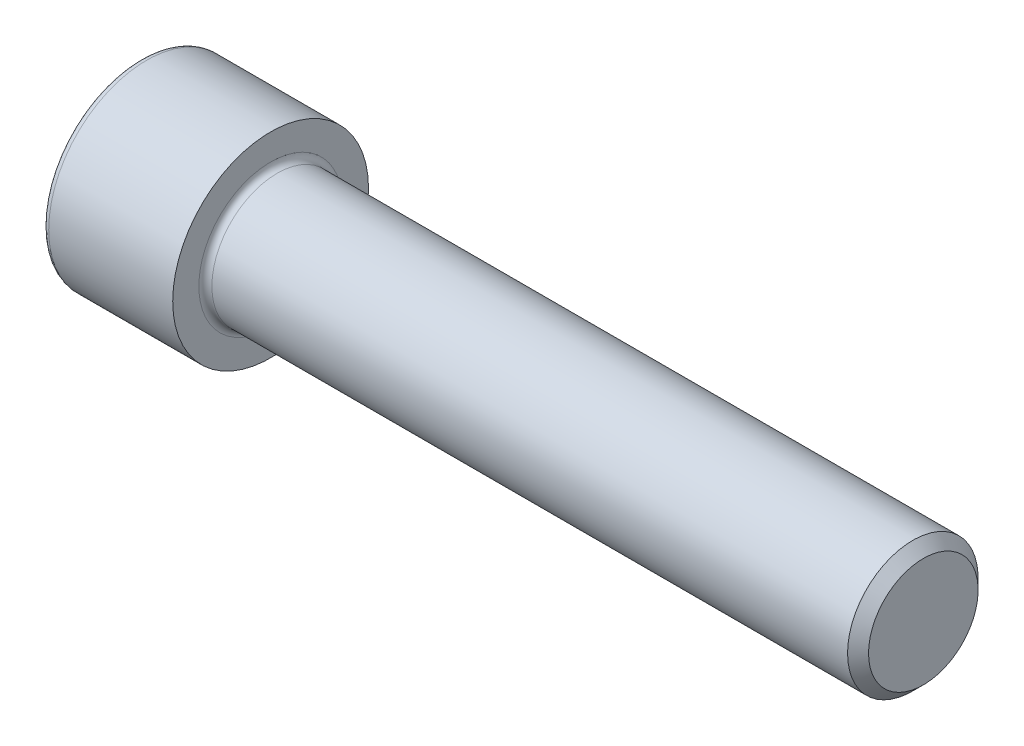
ISO-10303-21;
HEADER;
FILE_DESCRIPTION(('STEP AP214'),'2;1');
FILE_NAME('part.step','',(''),(''),'','','');
FILE_SCHEMA(('AUTOMOTIVE_DESIGN { 1 0 10303 214 1 1 1 1 }'));
ENDSEC;
DATA;
#1=APPLICATION_CONTEXT('core data for automotive mechanical design processes');
#2=APPLICATION_PROTOCOL_DEFINITION('international standard','automotive_design',2000,#1);
#3=PRODUCT_CONTEXT('',#1,'mechanical');
#4=PRODUCT('Part','Part','',(#3));
#5=PRODUCT_RELATED_PRODUCT_CATEGORY('part','',(#4));
#6=PRODUCT_DEFINITION_FORMATION('','',#4);
#7=PRODUCT_DEFINITION_CONTEXT('part definition',#1,'design');
#8=PRODUCT_DEFINITION('design','',#6,#7);
#9=PRODUCT_DEFINITION_SHAPE('','',#8);
#10=(LENGTH_UNIT() NAMED_UNIT(*) SI_UNIT(.MILLI.,.METRE.));
#11=(NAMED_UNIT(*) PLANE_ANGLE_UNIT() SI_UNIT($,.RADIAN.));
#12=(NAMED_UNIT(*) SI_UNIT($,.STERADIAN.) SOLID_ANGLE_UNIT());
#13=UNCERTAINTY_MEASURE_WITH_UNIT(LENGTH_MEASURE(1.E-05),#10,'distance_accuracy_value','');
#14=(GEOMETRIC_REPRESENTATION_CONTEXT(3) GLOBAL_UNCERTAINTY_ASSIGNED_CONTEXT((#13)) GLOBAL_UNIT_ASSIGNED_CONTEXT((#10,
#11,#12)) REPRESENTATION_CONTEXT('',''));
#15=CARTESIAN_POINT('',(0.,0.,0.));
#16=DIRECTION('',(0.,0.,1.));
#17=DIRECTION('',(1.,0.,0.));
#18=AXIS2_PLACEMENT_3D('',#15,#16,#17);
#19=CARTESIAN_POINT('',(0.,0.,0.));
#20=DIRECTION('',(-1.,0.,0.));
#21=DIRECTION('',(0.,0.,1.));
#22=AXIS2_PLACEMENT_3D('',#19,#20,#21);
#23=PLANE('',#22);
#24=DIRECTION('',(0.,-0.499999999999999,0.866025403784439));
#25=VECTOR('',#24,1.);
#26=CARTESIAN_POINT('',(0.,5.83989797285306,0.));
#27=LINE('',#26,#25);
#28=CARTESIAN_POINT('',(0.,5.83989797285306,0.));
#29=VERTEX_POINT('',#28);
#30=CARTESIAN_POINT('',(0.,2.91994898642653,5.0575));
#31=VERTEX_POINT('',#30);
#32=EDGE_CURVE('E266',#29,#31,#27,.T.);
#33=ORIENTED_EDGE('',*,*,#32,.T.);
#34=DIRECTION('',(0.,1.,0.));
#35=VECTOR('',#34,1.);
#36=CARTESIAN_POINT('',(0.,-2.91994898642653,5.0575));
#37=LINE('',#36,#35);
#38=CARTESIAN_POINT('',(0.,-2.91994898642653,5.0575));
#39=VERTEX_POINT('',#38);
#40=EDGE_CURVE('E138',#39,#31,#37,.T.);
#41=ORIENTED_EDGE('',*,*,#40,.F.);
#42=DIRECTION('',(0.,-0.500000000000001,-0.866025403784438));
#43=VECTOR('',#42,1.);
#44=CARTESIAN_POINT('',(0.,-2.91994898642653,5.0575));
#45=LINE('',#44,#43);
#46=CARTESIAN_POINT('',(0.,-5.83989797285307,0.));
#47=VERTEX_POINT('',#46);
#48=EDGE_CURVE('E269',#39,#47,#45,.T.);
#49=ORIENTED_EDGE('',*,*,#48,.T.);
#50=DIRECTION('',(0.,0.499999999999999,-0.866025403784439));
#51=VECTOR('',#50,1.);
#52=CARTESIAN_POINT('',(0.,-5.83989797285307,0.));
#53=LINE('',#52,#51);
#54=CARTESIAN_POINT('',(0.,-2.91994898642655,-5.0575));
#55=VERTEX_POINT('',#54);
#56=EDGE_CURVE('E272',#47,#55,#53,.T.);
#57=ORIENTED_EDGE('',*,*,#56,.T.);
#58=DIRECTION('',(0.,-1.,0.));
#59=VECTOR('',#58,1.);
#60=CARTESIAN_POINT('',(0.,2.91994898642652,-5.05750000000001));
#61=LINE('',#60,#59);
#62=CARTESIAN_POINT('',(0.,2.91994898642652,-5.05750000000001));
#63=VERTEX_POINT('',#62);
#64=EDGE_CURVE('E275',#63,#55,#61,.T.);
#65=ORIENTED_EDGE('',*,*,#64,.F.);
#66=DIRECTION('',(0.,-0.500000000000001,-0.866025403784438));
#67=VECTOR('',#66,1.);
#68=CARTESIAN_POINT('',(0.,5.83989797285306,0.));
#69=LINE('',#68,#67);
#70=EDGE_CURVE('E133',#29,#63,#69,.T.);
#71=ORIENTED_EDGE('',*,*,#70,.F.);
#72=EDGE_LOOP('',(#33,#41,#49,#57,#65,#71));
#73=FACE_BOUND('',#72,.T.);
#74=CARTESIAN_POINT('',(0.,0.,0.));
#75=DIRECTION('',(-1.,0.,0.));
#76=DIRECTION('',(0.,0.,1.));
#77=AXIS2_PLACEMENT_3D('',#74,#75,#76);
#78=CIRCLE('',#77,8.4);
#79=CARTESIAN_POINT('',(0.,0.,8.4));
#80=VERTEX_POINT('',#79);
#81=EDGE_CURVE('E50',#80,#80,#78,.T.);
#82=ORIENTED_EDGE('',*,*,#81,.T.);
#83=EDGE_LOOP('',(#82));
#84=FACE_BOUND('',#83,.T.);
#85=ADVANCED_FACE('F42',(#73,#84),#23,.T.);
#86=CARTESIAN_POINT('',(-31.75,0.,0.));
#87=DIRECTION('',(-1.,0.,0.));
#88=DIRECTION('',(0.,0.,1.));
#89=AXIS2_PLACEMENT_3D('',#86,#87,#88);
#90=CYLINDRICAL_SURFACE('',#89,9.);
#91=CARTESIAN_POINT('',(0.600000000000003,0.,0.));
#92=DIRECTION('',(-1.,0.,0.));
#93=DIRECTION('',(0.,0.,1.));
#94=AXIS2_PLACEMENT_3D('',#91,#92,#93);
#95=CIRCLE('',#94,9.);
#96=CARTESIAN_POINT('',(0.600000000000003,0.,9.));
#97=VERTEX_POINT('',#96);
#98=EDGE_CURVE('E13',#97,#97,#95,.F.);
#99=ORIENTED_EDGE('',*,*,#98,.T.);
#100=EDGE_LOOP('',(#99));
#101=FACE_BOUND('',#100,.T.);
#102=CARTESIAN_POINT('',(12.,0.,0.));
#103=DIRECTION('',(-1.,0.,0.));
#104=DIRECTION('',(0.,0.,1.));
#105=AXIS2_PLACEMENT_3D('',#102,#103,#104);
#106=CIRCLE('',#105,9.);
#107=CARTESIAN_POINT('',(12.,0.,9.));
#108=VERTEX_POINT('',#107);
#109=EDGE_CURVE('E156',#108,#108,#106,.T.);
#110=ORIENTED_EDGE('',*,*,#109,.T.);
#111=EDGE_LOOP('',(#110));
#112=FACE_BOUND('',#111,.T.);
#113=ADVANCED_FACE('F180',(#101,#112),#90,.T.);
#114=CARTESIAN_POINT('',(12.,9.,0.));
#115=DIRECTION('',(1.,0.,0.));
#116=DIRECTION('',(0.,0.,-1.));
#117=AXIS2_PLACEMENT_3D('',#114,#115,#116);
#118=PLANE('',#117);
#119=CARTESIAN_POINT('',(12.,0.,0.));
#120=DIRECTION('',(1.,0.,0.));
#121=DIRECTION('',(0.,0.,-1.));
#122=AXIS2_PLACEMENT_3D('',#119,#120,#121);
#123=CIRCLE('',#122,6.59999999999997);
#124=CARTESIAN_POINT('',(12.,0.,-6.59999999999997));
#125=VERTEX_POINT('',#124);
#126=EDGE_CURVE('E159',#125,#125,#123,.F.);
#127=ORIENTED_EDGE('',*,*,#126,.T.);
#128=EDGE_LOOP('',(#127));
#129=FACE_BOUND('',#128,.T.);
#130=ORIENTED_EDGE('',*,*,#109,.F.);
#131=EDGE_LOOP('',(#130));
#132=FACE_BOUND('',#131,.T.);
#133=ADVANCED_FACE('F186',(#129,#132),#118,.T.);
#134=CARTESIAN_POINT('',(-31.75,0.,0.));
#135=DIRECTION('',(-1.,0.,0.));
#136=DIRECTION('',(0.,0.,1.));
#137=AXIS2_PLACEMENT_3D('',#134,#135,#136);
#138=CYLINDRICAL_SURFACE('',#137,5.99999999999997);
#139=CARTESIAN_POINT('',(12.6,0.,0.));
#140=DIRECTION('',(1.,0.,0.));
#141=DIRECTION('',(0.,0.,-1.));
#142=AXIS2_PLACEMENT_3D('',#139,#140,#141);
#143=CIRCLE('',#142,5.99999999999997);
#144=CARTESIAN_POINT('',(12.6,0.,-5.99999999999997));
#145=VERTEX_POINT('',#144);
#146=EDGE_CURVE('E162',#145,#145,#143,.T.);
#147=ORIENTED_EDGE('',*,*,#146,.T.);
#148=EDGE_LOOP('',(#147));
#149=FACE_BOUND('',#148,.T.);
#150=CARTESIAN_POINT('',(71.0359999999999,0.,0.));
#151=DIRECTION('',(-1.,0.,0.));
#152=DIRECTION('',(0.,0.,1.));
#153=AXIS2_PLACEMENT_3D('',#150,#151,#152);
#154=CIRCLE('',#153,5.99999999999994);
#155=CARTESIAN_POINT('',(71.0359999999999,0.,5.99999999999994));
#156=VERTEX_POINT('',#155);
#157=EDGE_CURVE('E153',#156,#156,#154,.T.);
#158=ORIENTED_EDGE('',*,*,#157,.T.);
#159=EDGE_LOOP('',(#158));
#160=FACE_BOUND('',#159,.T.);
#161=ADVANCED_FACE('F192',(#149,#160),#138,.T.);
#162=CARTESIAN_POINT('',(72.,0.,0.));
#163=DIRECTION('',(-1.,0.,0.));
#164=DIRECTION('',(0.,0.,1.));
#165=AXIS2_PLACEMENT_3D('',#162,#163,#164);
#166=CONICAL_SURFACE('',#165,5.036,0.785398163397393);
#167=ORIENTED_EDGE('',*,*,#157,.F.);
#168=EDGE_LOOP('',(#167));
#169=FACE_BOUND('',#168,.T.);
#170=CARTESIAN_POINT('',(72.,0.,0.));
#171=DIRECTION('',(-1.,0.,0.));
#172=DIRECTION('',(0.,0.,1.));
#173=AXIS2_PLACEMENT_3D('',#170,#171,#172);
#174=CIRCLE('',#173,5.036);
#175=CARTESIAN_POINT('',(72.,0.,5.036));
#176=VERTEX_POINT('',#175);
#177=EDGE_CURVE('E149',#176,#176,#174,.T.);
#178=ORIENTED_EDGE('',*,*,#177,.T.);
#179=EDGE_LOOP('',(#178));
#180=FACE_BOUND('',#179,.T.);
#181=ADVANCED_FACE('F196',(#169,#180),#166,.T.);
#182=CARTESIAN_POINT('',(72.,5.036,0.));
#183=DIRECTION('',(1.,0.,0.));
#184=DIRECTION('',(0.,0.,-1.));
#185=AXIS2_PLACEMENT_3D('',#182,#183,#184);
#186=PLANE('',#185);
#187=ORIENTED_EDGE('',*,*,#177,.F.);
#188=EDGE_LOOP('',(#187));
#189=FACE_BOUND('',#188,.T.);
#190=ADVANCED_FACE('F176',(#189),#186,.T.);
#191=CARTESIAN_POINT('',(12.6,0.,0.));
#192=DIRECTION('',(1.,0.,0.));
#193=DIRECTION('',(0.,0.,-1.));
#194=AXIS2_PLACEMENT_3D('',#191,#192,#193);
#195=TOROIDAL_SURFACE('',#194,6.59999999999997,0.6);
#196=ORIENTED_EDGE('',*,*,#146,.F.);
#197=EDGE_LOOP('',(#196));
#198=FACE_BOUND('',#197,.T.);
#199=ORIENTED_EDGE('',*,*,#126,.F.);
#200=EDGE_LOOP('',(#199));
#201=FACE_BOUND('',#200,.T.);
#202=ADVANCED_FACE('F169',(#198,#201),#195,.F.);
#203=CARTESIAN_POINT('',(0.600000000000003,0.,0.));
#204=DIRECTION('',(-1.,0.,0.));
#205=DIRECTION('',(0.,0.,1.));
#206=AXIS2_PLACEMENT_3D('',#203,#204,#205);
#207=TOROIDAL_SURFACE('',#206,8.4,0.6);
#208=ORIENTED_EDGE('',*,*,#98,.F.);
#209=EDGE_LOOP('',(#208));
#210=FACE_BOUND('',#209,.T.);
#211=ORIENTED_EDGE('',*,*,#81,.F.);
#212=EDGE_LOOP('',(#211));
#213=FACE_BOUND('',#212,.T.);
#214=ADVANCED_FACE('F44',(#210,#213),#207,.T.);
#215=CARTESIAN_POINT('',(6.,5.83989797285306,0.));
#216=DIRECTION('',(0.,-0.866025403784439,-0.499999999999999));
#217=DIRECTION('',(0.,0.499999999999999,-0.866025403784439));
#218=AXIS2_PLACEMENT_3D('',#215,#216,#217);
#219=PLANE('',#218);
#220=ORIENTED_EDGE('',*,*,#32,.F.);
#221=DIRECTION('',(-1.,0.,0.));
#222=VECTOR('',#221,1.);
#223=CARTESIAN_POINT('',(6.,5.83989797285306,0.));
#224=LINE('',#223,#222);
#225=CARTESIAN_POINT('',(6.,5.83989797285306,0.));
#226=VERTEX_POINT('',#225);
#227=EDGE_CURVE('E256',#226,#29,#224,.T.);
#228=ORIENTED_EDGE('',*,*,#227,.F.);
#229=DIRECTION('',(0.,-0.499999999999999,0.866025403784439));
#230=VECTOR('',#229,1.);
#231=CARTESIAN_POINT('',(6.,5.83989797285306,0.));
#232=LINE('',#231,#230);
#233=CARTESIAN_POINT('',(6.,4.3799234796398,2.52875));
#234=VERTEX_POINT('',#233);
#235=EDGE_CURVE('E125',#226,#234,#232,.T.);
#236=ORIENTED_EDGE('',*,*,#235,.T.);
#237=CARTESIAN_POINT('',(6.,2.91994898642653,5.0575));
#238=VERTEX_POINT('',#237);
#239=EDGE_CURVE('E116',#234,#238,#232,.T.);
#240=ORIENTED_EDGE('',*,*,#239,.T.);
#241=DIRECTION('',(-1.,0.,0.));
#242=VECTOR('',#241,1.);
#243=CARTESIAN_POINT('',(6.,2.91994898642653,5.0575));
#244=LINE('',#243,#242);
#245=EDGE_CURVE('E130',#238,#31,#244,.T.);
#246=ORIENTED_EDGE('',*,*,#245,.T.);
#247=EDGE_LOOP('',(#220,#228,#236,#240,#246));
#248=FACE_BOUND('',#247,.T.);
#249=ADVANCED_FACE('F129',(#248),#219,.T.);
#250=CARTESIAN_POINT('',(6.,-2.91994898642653,5.0575));
#251=DIRECTION('',(0.,0.,1.));
#252=DIRECTION('',(0.,-1.,0.));
#253=AXIS2_PLACEMENT_3D('',#250,#251,#252);
#254=PLANE('',#253);
#255=ORIENTED_EDGE('',*,*,#40,.T.);
#256=ORIENTED_EDGE('',*,*,#245,.F.);
#257=DIRECTION('',(0.,1.,0.));
#258=VECTOR('',#257,1.);
#259=CARTESIAN_POINT('',(6.,-2.91994898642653,5.0575));
#260=LINE('',#259,#258);
#261=CARTESIAN_POINT('',(6.,0.,5.0575));
#262=VERTEX_POINT('',#261);
#263=EDGE_CURVE('E113',#262,#238,#260,.T.);
#264=ORIENTED_EDGE('',*,*,#263,.F.);
#265=CARTESIAN_POINT('',(6.,-2.91994898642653,5.0575));
#266=VERTEX_POINT('',#265);
#267=EDGE_CURVE('E124',#266,#262,#260,.T.);
#268=ORIENTED_EDGE('',*,*,#267,.F.);
#269=DIRECTION('',(-1.,0.,0.));
#270=VECTOR('',#269,1.);
#271=CARTESIAN_POINT('',(6.,-2.91994898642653,5.0575));
#272=LINE('',#271,#270);
#273=EDGE_CURVE('E140',#266,#39,#272,.T.);
#274=ORIENTED_EDGE('',*,*,#273,.T.);
#275=EDGE_LOOP('',(#255,#256,#264,#268,#274));
#276=FACE_BOUND('',#275,.T.);
#277=ADVANCED_FACE('F135',(#276),#254,.F.);
#278=CARTESIAN_POINT('',(6.,-2.91994898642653,5.0575));
#279=DIRECTION('',(0.,0.866025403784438,-0.500000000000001));
#280=DIRECTION('',(0.,0.500000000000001,0.866025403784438));
#281=AXIS2_PLACEMENT_3D('',#278,#279,#280);
#282=PLANE('',#281);
#283=ORIENTED_EDGE('',*,*,#48,.F.);
#284=ORIENTED_EDGE('',*,*,#273,.F.);
#285=DIRECTION('',(0.,-0.500000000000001,-0.866025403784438));
#286=VECTOR('',#285,1.);
#287=CARTESIAN_POINT('',(6.,-2.91994898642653,5.0575));
#288=LINE('',#287,#286);
#289=CARTESIAN_POINT('',(6.,-4.3799234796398,2.52875000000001));
#290=VERTEX_POINT('',#289);
#291=EDGE_CURVE('E295',#266,#290,#288,.T.);
#292=ORIENTED_EDGE('',*,*,#291,.T.);
#293=CARTESIAN_POINT('',(6.,-5.83989797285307,0.));
#294=VERTEX_POINT('',#293);
#295=EDGE_CURVE('E284',#290,#294,#288,.T.);
#296=ORIENTED_EDGE('',*,*,#295,.T.);
#297=DIRECTION('',(-1.,0.,0.));
#298=VECTOR('',#297,1.);
#299=CARTESIAN_POINT('',(6.,-5.83989797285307,0.));
#300=LINE('',#299,#298);
#301=EDGE_CURVE('E145',#294,#47,#300,.T.);
#302=ORIENTED_EDGE('',*,*,#301,.T.);
#303=EDGE_LOOP('',(#283,#284,#292,#296,#302));
#304=FACE_BOUND('',#303,.T.);
#305=ADVANCED_FACE('F210',(#304),#282,.T.);
#306=CARTESIAN_POINT('',(6.,-5.83989797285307,0.));
#307=DIRECTION('',(0.,0.866025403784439,0.499999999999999));
#308=DIRECTION('',(0.,-0.499999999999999,0.866025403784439));
#309=AXIS2_PLACEMENT_3D('',#306,#307,#308);
#310=PLANE('',#309);
#311=ORIENTED_EDGE('',*,*,#56,.F.);
#312=ORIENTED_EDGE('',*,*,#301,.F.);
#313=DIRECTION('',(0.,0.499999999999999,-0.866025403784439));
#314=VECTOR('',#313,1.);
#315=CARTESIAN_POINT('',(6.,-5.83989797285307,0.));
#316=LINE('',#315,#314);
#317=CARTESIAN_POINT('',(6.,-4.37992347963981,-2.52875));
#318=VERTEX_POINT('',#317);
#319=EDGE_CURVE('E262',#294,#318,#316,.T.);
#320=ORIENTED_EDGE('',*,*,#319,.T.);
#321=CARTESIAN_POINT('',(6.,-2.91994898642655,-5.0575));
#322=VERTEX_POINT('',#321);
#323=EDGE_CURVE('E294',#318,#322,#316,.T.);
#324=ORIENTED_EDGE('',*,*,#323,.T.);
#325=DIRECTION('',(-1.,0.,0.));
#326=VECTOR('',#325,1.);
#327=CARTESIAN_POINT('',(6.,-2.91994898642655,-5.0575));
#328=LINE('',#327,#326);
#329=EDGE_CURVE('E255',#322,#55,#328,.T.);
#330=ORIENTED_EDGE('',*,*,#329,.T.);
#331=EDGE_LOOP('',(#311,#312,#320,#324,#330));
#332=FACE_BOUND('',#331,.T.);
#333=ADVANCED_FACE('F213',(#332),#310,.T.);
#334=CARTESIAN_POINT('',(6.,2.91994898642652,-5.05750000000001));
#335=DIRECTION('',(0.,0.,-1.));
#336=DIRECTION('',(0.,1.,0.));
#337=AXIS2_PLACEMENT_3D('',#334,#335,#336);
#338=PLANE('',#337);
#339=ORIENTED_EDGE('',*,*,#64,.T.);
#340=ORIENTED_EDGE('',*,*,#329,.F.);
#341=DIRECTION('',(0.,-1.,0.));
#342=VECTOR('',#341,1.);
#343=CARTESIAN_POINT('',(6.,2.91994898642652,-5.05750000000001));
#344=LINE('',#343,#342);
#345=CARTESIAN_POINT('',(6.,0.,-5.0575));
#346=VERTEX_POINT('',#345);
#347=EDGE_CURVE('E259',#346,#322,#344,.T.);
#348=ORIENTED_EDGE('',*,*,#347,.F.);
#349=CARTESIAN_POINT('',(6.,2.91994898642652,-5.05750000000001));
#350=VERTEX_POINT('',#349);
#351=EDGE_CURVE('E57',#350,#346,#344,.T.);
#352=ORIENTED_EDGE('',*,*,#351,.F.);
#353=DIRECTION('',(-1.,0.,0.));
#354=VECTOR('',#353,1.);
#355=CARTESIAN_POINT('',(6.,2.91994898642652,-5.05750000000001));
#356=LINE('',#355,#354);
#357=EDGE_CURVE('E252',#350,#63,#356,.T.);
#358=ORIENTED_EDGE('',*,*,#357,.T.);
#359=EDGE_LOOP('',(#339,#340,#348,#352,#358));
#360=FACE_BOUND('',#359,.T.);
#361=ADVANCED_FACE('F217',(#360),#338,.F.);
#362=CARTESIAN_POINT('',(6.,5.83989797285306,0.));
#363=DIRECTION('',(0.,0.866025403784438,-0.500000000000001));
#364=DIRECTION('',(0.,0.500000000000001,0.866025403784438));
#365=AXIS2_PLACEMENT_3D('',#362,#363,#364);
#366=PLANE('',#365);
#367=ORIENTED_EDGE('',*,*,#70,.T.);
#368=ORIENTED_EDGE('',*,*,#357,.F.);
#369=DIRECTION('',(0.,-0.500000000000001,-0.866025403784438));
#370=VECTOR('',#369,1.);
#371=CARTESIAN_POINT('',(6.,5.83989797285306,0.));
#372=LINE('',#371,#370);
#373=CARTESIAN_POINT('',(6.,4.37992347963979,-2.52875000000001));
#374=VERTEX_POINT('',#373);
#375=EDGE_CURVE('E242',#374,#350,#372,.T.);
#376=ORIENTED_EDGE('',*,*,#375,.F.);
#377=EDGE_CURVE('E248',#226,#374,#372,.T.);
#378=ORIENTED_EDGE('',*,*,#377,.F.);
#379=ORIENTED_EDGE('',*,*,#227,.T.);
#380=EDGE_LOOP('',(#367,#368,#376,#378,#379));
#381=FACE_BOUND('',#380,.T.);
#382=ADVANCED_FACE('F221',(#381),#366,.F.);
#383=CARTESIAN_POINT('',(6.,5.83989797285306,0.));
#384=DIRECTION('',(1.,0.,0.));
#385=DIRECTION('',(0.,0.,-1.));
#386=AXIS2_PLACEMENT_3D('',#383,#384,#385);
#387=PLANE('',#386);
#388=ORIENTED_EDGE('',*,*,#347,.T.);
#389=ORIENTED_EDGE('',*,*,#323,.F.);
#390=CARTESIAN_POINT('',(6.,0.,0.));
#391=DIRECTION('',(-1.,0.,0.));
#392=DIRECTION('',(0.,0.,1.));
#393=AXIS2_PLACEMENT_3D('',#390,#391,#392);
#394=CIRCLE('',#393,5.0575);
#395=EDGE_CURVE('E290',#346,#318,#394,.T.);
#396=ORIENTED_EDGE('',*,*,#395,.F.);
#397=EDGE_LOOP('',(#388,#389,#396));
#398=FACE_BOUND('',#397,.T.);
#399=ADVANCED_FACE('F225',(#398),#387,.F.);
#400=ORIENTED_EDGE('',*,*,#319,.F.);
#401=ORIENTED_EDGE('',*,*,#295,.F.);
#402=EDGE_CURVE('E143',#318,#290,#394,.T.);
#403=ORIENTED_EDGE('',*,*,#402,.F.);
#404=EDGE_LOOP('',(#400,#401,#403));
#405=FACE_BOUND('',#404,.T.);
#406=ADVANCED_FACE('F228',(#405),#387,.F.);
#407=ORIENTED_EDGE('',*,*,#291,.F.);
#408=ORIENTED_EDGE('',*,*,#267,.T.);
#409=EDGE_CURVE('E139',#290,#262,#394,.T.);
#410=ORIENTED_EDGE('',*,*,#409,.F.);
#411=EDGE_LOOP('',(#407,#408,#410));
#412=FACE_BOUND('',#411,.T.);
#413=ADVANCED_FACE('F233',(#412),#387,.F.);
#414=ORIENTED_EDGE('',*,*,#263,.T.);
#415=ORIENTED_EDGE('',*,*,#239,.F.);
#416=EDGE_CURVE('E119',#262,#234,#394,.T.);
#417=ORIENTED_EDGE('',*,*,#416,.F.);
#418=EDGE_LOOP('',(#414,#415,#417));
#419=FACE_BOUND('',#418,.T.);
#420=ADVANCED_FACE('F115',(#419),#387,.F.);
#421=ORIENTED_EDGE('',*,*,#235,.F.);
#422=ORIENTED_EDGE('',*,*,#377,.T.);
#423=EDGE_CURVE('E150',#234,#374,#394,.T.);
#424=ORIENTED_EDGE('',*,*,#423,.F.);
#425=EDGE_LOOP('',(#421,#422,#424));
#426=FACE_BOUND('',#425,.T.);
#427=ADVANCED_FACE('F236',(#426),#387,.F.);
#428=ORIENTED_EDGE('',*,*,#375,.T.);
#429=ORIENTED_EDGE('',*,*,#351,.T.);
#430=EDGE_CURVE('E245',#374,#346,#394,.T.);
#431=ORIENTED_EDGE('',*,*,#430,.F.);
#432=EDGE_LOOP('',(#428,#429,#431));
#433=FACE_BOUND('',#432,.T.);
#434=ADVANCED_FACE('F206',(#433),#387,.F.);
#435=CARTESIAN_POINT('',(6.,0.,0.));
#436=DIRECTION('',(-1.,0.,0.));
#437=DIRECTION('',(0.,0.,1.));
#438=AXIS2_PLACEMENT_3D('',#435,#436,#437);
#439=CONICAL_SURFACE('',#438,5.0575,1.04719755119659);
#440=CARTESIAN_POINT('',(8.91994898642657,0.,0.));
#441=VERTEX_POINT('',#440);
#442=VERTEX_LOOP('',#441);
#443=FACE_BOUND('',#442,.T.);
#444=ORIENTED_EDGE('',*,*,#416,.T.);
#445=ORIENTED_EDGE('',*,*,#423,.T.);
#446=ORIENTED_EDGE('',*,*,#430,.T.);
#447=ORIENTED_EDGE('',*,*,#395,.T.);
#448=ORIENTED_EDGE('',*,*,#402,.T.);
#449=ORIENTED_EDGE('',*,*,#409,.T.);
#450=EDGE_LOOP('',(#444,#445,#446,#447,#448,#449));
#451=FACE_BOUND('',#450,.T.);
#452=ADVANCED_FACE('F204',(#443,#451),#439,.F.);
#453=CLOSED_SHELL('',(#85,#113,#133,#161,#181,#190,#202,#214,#249,#277,#305,#333,#361,#382,#399,
#406,#413,#420,#427,#434,#452));
#454=MANIFOLD_SOLID_BREP('B2',#453);
#455=ADVANCED_BREP_SHAPE_REPRESENTATION('',(#18,#454),#14);
#456=SHAPE_DEFINITION_REPRESENTATION(#9,#455);
ENDSEC;
END-ISO-10303-21;
